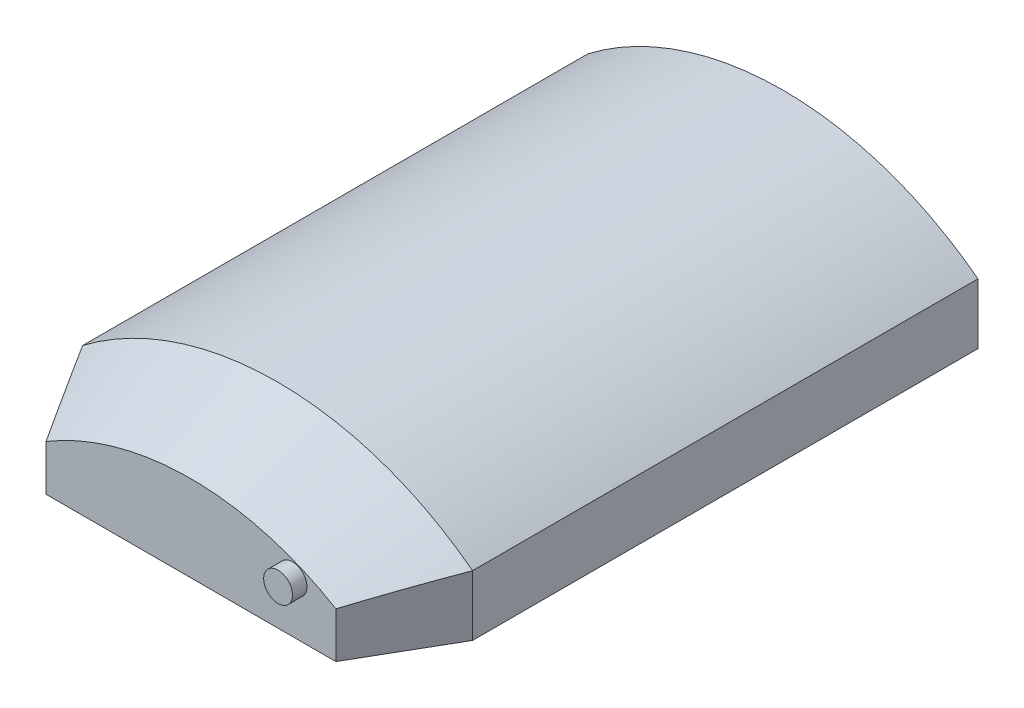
from build123d import *

# Parameters (mm, degrees)
BOSS_EXTRUDE1_DEPTH = 260.35
CHAMFER1_SIZE       = 38.1
CHAMFER1_SIZE2      = 17.766321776
CUT_EXTRUDE1_DEPTH  = 280.674971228
SKETCH3_R           = 6.35
BOSS_EXTRUDE2_DEPTH = 6.35


with BuildPart() as part:
    # Sketch1 → Boss-Extrude1 (new body)
    with BuildSketch(Plane.XY):
        with BuildLine():
            Line((-85.725, 112.309314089), (-85.725, 85.725))
            Line((-85.725, 85.725), (85.725, 85.725))
            Line((85.725, 85.725), (85.725, 112.309314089))
            ThreePointArc((85.725, 112.309314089), (0, 141.2875), (-85.725, 112.309314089))
        make_face()
    extrude(amount=BOSS_EXTRUDE1_DEPTH)

    # Chamfer1
    chamfer1_edges = [part.edges().sort_by_distance(p)[0] for p in [
        (0, 141.2875, 260.35),
    ]]
    chamfer1_side = [part.faces().sort_by_distance(p)[0] for p in [
        (0, 141.2875, 130.175),
    ]]
    chamfer(chamfer1_edges, length=CHAMFER1_SIZE, length2=CHAMFER1_SIZE2, reference=chamfer1_side[0])

    # Sketch2 → Cut-Extrude1 (cut, through all)
    with BuildSketch(Plane.XZ.offset(-85.725)):
        Polygon((-63.727954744, 260.35), (-85.725, 222.25), (-85.725, 260.35), align=None)
        Polygon((85.725, 222.25), (63.727954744, 260.35), (85.725, 260.35), align=None)
    extrude(amount=-CUT_EXTRUDE1_DEPTH, mode=Mode.SUBTRACT)

    # Sketch3 → Boss-Extrude2 (add)
    with BuildSketch(Plane.XY.offset(260.35)):
        with Locations((44.67352, 107.852355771)):
            Circle(SKETCH3_R)
    extrude(amount=BOSS_EXTRUDE2_DEPTH)


solid = part.part
